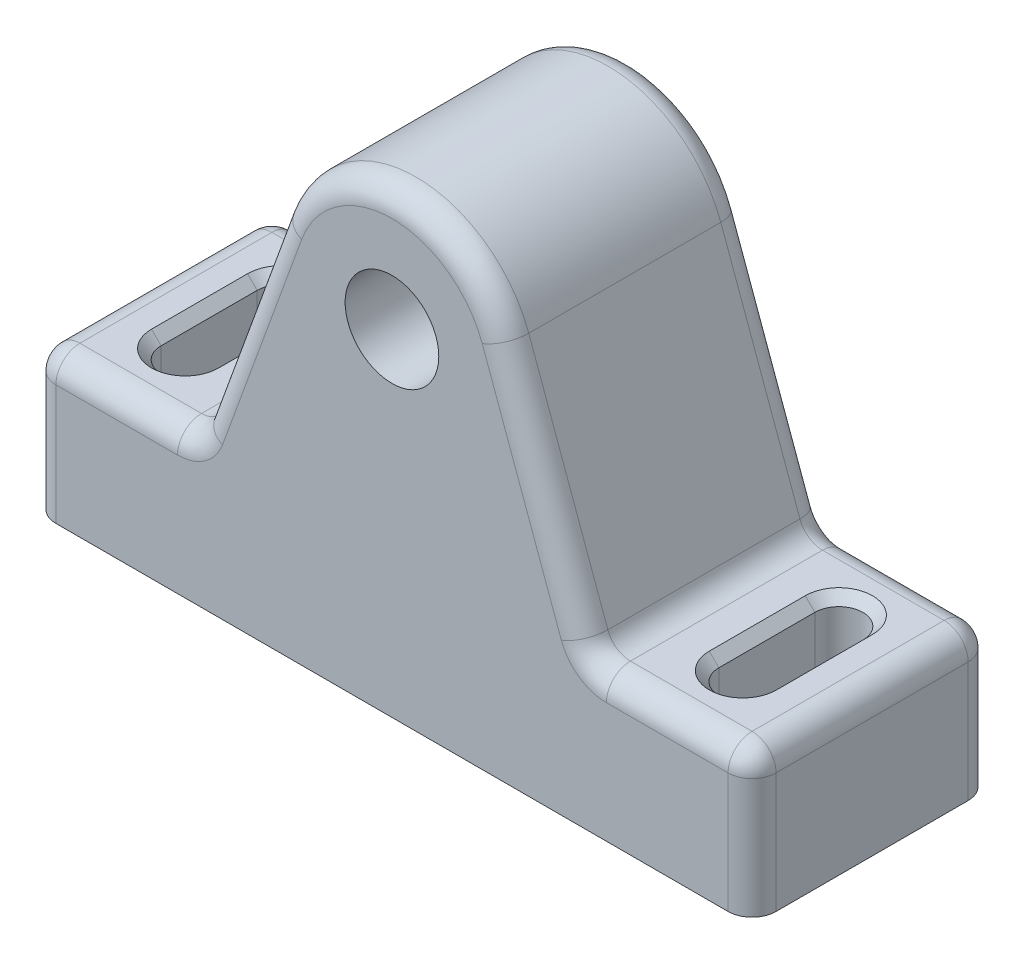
ISO-10303-21;
HEADER;
FILE_DESCRIPTION(('STEP AP214'),'2;1');
FILE_NAME('part.step','',(''),(''),'','','');
FILE_SCHEMA(('AUTOMOTIVE_DESIGN { 1 0 10303 214 1 1 1 1 }'));
ENDSEC;
DATA;
#1=APPLICATION_CONTEXT('core data for automotive mechanical design processes');
#2=APPLICATION_PROTOCOL_DEFINITION('international standard','automotive_design',2000,#1);
#3=PRODUCT_CONTEXT('',#1,'mechanical');
#4=PRODUCT('Part','Part','',(#3));
#5=PRODUCT_RELATED_PRODUCT_CATEGORY('part','',(#4));
#6=PRODUCT_DEFINITION_FORMATION('','',#4);
#7=PRODUCT_DEFINITION_CONTEXT('part definition',#1,'design');
#8=PRODUCT_DEFINITION('design','',#6,#7);
#9=PRODUCT_DEFINITION_SHAPE('','',#8);
#10=(LENGTH_UNIT() NAMED_UNIT(*) SI_UNIT(.MILLI.,.METRE.));
#11=(NAMED_UNIT(*) PLANE_ANGLE_UNIT() SI_UNIT($,.RADIAN.));
#12=(NAMED_UNIT(*) SI_UNIT($,.STERADIAN.) SOLID_ANGLE_UNIT());
#13=UNCERTAINTY_MEASURE_WITH_UNIT(LENGTH_MEASURE(1.E-05),#10,'distance_accuracy_value','');
#14=(GEOMETRIC_REPRESENTATION_CONTEXT(3) GLOBAL_UNCERTAINTY_ASSIGNED_CONTEXT((#13)) GLOBAL_UNIT_ASSIGNED_CONTEXT((#10,
#11,#12)) REPRESENTATION_CONTEXT('',''));
#15=CARTESIAN_POINT('',(0.,0.,0.));
#16=DIRECTION('',(0.,0.,1.));
#17=DIRECTION('',(1.,0.,0.));
#18=AXIS2_PLACEMENT_3D('',#15,#16,#17);
#19=CARTESIAN_POINT('',(0.,70.,25.));
#20=DIRECTION('',(0.,0.,-1.));
#21=DIRECTION('',(-1.,0.,0.));
#22=AXIS2_PLACEMENT_3D('',#19,#20,#21);
#23=PLANE('',#22);
#24=DIRECTION('',(1.,0.,0.));
#25=VECTOR('',#24,1.);
#26=CARTESIAN_POINT('',(75.,0.,25.));
#27=LINE('',#26,#25);
#28=CARTESIAN_POINT('',(-70.,0.,25.));
#29=VERTEX_POINT('',#28);
#30=CARTESIAN_POINT('',(70.,0.,25.));
#31=VERTEX_POINT('',#30);
#32=EDGE_CURVE('E332',#29,#31,#27,.T.);
#33=ORIENTED_EDGE('',*,*,#32,.T.);
#34=DIRECTION('',(0.,1.,0.));
#35=VECTOR('',#34,1.);
#36=CARTESIAN_POINT('',(70.,70.,25.));
#37=LINE('',#36,#35);
#38=CARTESIAN_POINT('',(70.,25.,25.));
#39=VERTEX_POINT('',#38);
#40=EDGE_CURVE('E368',#31,#39,#37,.T.);
#41=ORIENTED_EDGE('',*,*,#40,.T.);
#42=DIRECTION('',(-1.,0.,0.));
#43=VECTOR('',#42,1.);
#44=CARTESIAN_POINT('',(0.,25.,25.));
#45=LINE('',#44,#43);
#46=CARTESIAN_POINT('',(44.6642913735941,25.,25.));
#47=VERTEX_POINT('',#46);
#48=EDGE_CURVE('E365',#39,#47,#45,.T.);
#49=ORIENTED_EDGE('',*,*,#48,.T.);
#50=CARTESIAN_POINT('',(44.6642913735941,35.,25.));
#51=DIRECTION('',(0.,0.,-1.));
#52=DIRECTION('',(-1.,0.,0.));
#53=AXIS2_PLACEMENT_3D('',#50,#51,#52);
#54=CIRCLE('',#53,10.);
#55=CARTESIAN_POINT('',(35.267365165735,31.5797985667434,25.));
#56=VERTEX_POINT('',#55);
#57=EDGE_CURVE('E362',#56,#47,#54,.F.);
#58=ORIENTED_EDGE('',*,*,#57,.F.);
#59=DIRECTION('',(-0.342020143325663,0.939692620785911,0.));
#60=VECTOR('',#59,1.);
#61=CARTESIAN_POINT('',(18.7938524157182,76.8404028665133,25.));
#62=LINE('',#61,#60);
#63=CARTESIAN_POINT('',(18.7938524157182,76.8404028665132,25.));
#64=VERTEX_POINT('',#63);
#65=EDGE_CURVE('E360',#56,#64,#62,.T.);
#66=ORIENTED_EDGE('',*,*,#65,.T.);
#67=CARTESIAN_POINT('',(0.,70.,25.));
#68=DIRECTION('',(0.,0.,-1.));
#69=DIRECTION('',(-1.,0.,0.));
#70=AXIS2_PLACEMENT_3D('',#67,#68,#69);
#71=CIRCLE('',#70,20.);
#72=CARTESIAN_POINT('',(-18.7938524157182,76.8404028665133,25.));
#73=VERTEX_POINT('',#72);
#74=EDGE_CURVE('E358',#64,#73,#71,.F.);
#75=ORIENTED_EDGE('',*,*,#74,.T.);
#76=DIRECTION('',(-0.342020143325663,-0.939692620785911,0.));
#77=VECTOR('',#76,1.);
#78=CARTESIAN_POINT('',(-18.7938524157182,76.8404028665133,25.));
#79=LINE('',#78,#77);
#80=CARTESIAN_POINT('',(-35.267365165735,31.5797985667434,25.));
#81=VERTEX_POINT('',#80);
#82=EDGE_CURVE('E356',#73,#81,#79,.T.);
#83=ORIENTED_EDGE('',*,*,#82,.T.);
#84=CARTESIAN_POINT('',(-44.6642913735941,35.,25.));
#85=DIRECTION('',(0.,0.,-1.));
#86=DIRECTION('',(-1.,0.,0.));
#87=AXIS2_PLACEMENT_3D('',#84,#85,#86);
#88=CIRCLE('',#87,10.);
#89=CARTESIAN_POINT('',(-44.6642913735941,25.,25.));
#90=VERTEX_POINT('',#89);
#91=EDGE_CURVE('E353',#90,#81,#88,.F.);
#92=ORIENTED_EDGE('',*,*,#91,.F.);
#93=DIRECTION('',(-1.,0.,0.));
#94=VECTOR('',#93,1.);
#95=CARTESIAN_POINT('',(0.,25.,25.));
#96=LINE('',#95,#94);
#97=CARTESIAN_POINT('',(-70.,25.,25.));
#98=VERTEX_POINT('',#97);
#99=EDGE_CURVE('E351',#90,#98,#96,.T.);
#100=ORIENTED_EDGE('',*,*,#99,.T.);
#101=DIRECTION('',(0.,-1.,0.));
#102=VECTOR('',#101,1.);
#103=CARTESIAN_POINT('',(-70.,70.,25.));
#104=LINE('',#103,#102);
#105=EDGE_CURVE('E349',#98,#29,#104,.T.);
#106=ORIENTED_EDGE('',*,*,#105,.T.);
#107=EDGE_LOOP('',(#33,#41,#49,#58,#66,#75,#83,#92,#100,#106));
#108=FACE_BOUND('',#107,.T.);
#109=CARTESIAN_POINT('',(0.,70.,25.));
#110=DIRECTION('',(0.,0.,1.));
#111=DIRECTION('',(1.,0.,0.));
#112=AXIS2_PLACEMENT_3D('',#109,#110,#111);
#113=CIRCLE('',#112,9.75);
#114=CARTESIAN_POINT('',(9.75,70.,25.));
#115=VERTEX_POINT('',#114);
#116=EDGE_CURVE('E326',#115,#115,#113,.T.);
#117=ORIENTED_EDGE('',*,*,#116,.F.);
#118=EDGE_LOOP('',(#117));
#119=FACE_BOUND('',#118,.T.);
#120=ADVANCED_FACE('F44',(#108,#119),#23,.F.);
#121=CARTESIAN_POINT('',(0.,70.,-25.));
#122=DIRECTION('',(0.,0.,-1.));
#123=DIRECTION('',(-1.,0.,0.));
#124=AXIS2_PLACEMENT_3D('',#121,#122,#123);
#125=PLANE('',#124);
#126=DIRECTION('',(1.,0.,0.));
#127=VECTOR('',#126,1.);
#128=CARTESIAN_POINT('',(75.,0.,-25.));
#129=LINE('',#128,#127);
#130=CARTESIAN_POINT('',(-70.,0.,-25.));
#131=VERTEX_POINT('',#130);
#132=CARTESIAN_POINT('',(70.,0.,-25.));
#133=VERTEX_POINT('',#132);
#134=EDGE_CURVE('E329',#131,#133,#129,.T.);
#135=ORIENTED_EDGE('',*,*,#134,.F.);
#136=DIRECTION('',(0.,-1.,0.));
#137=VECTOR('',#136,1.);
#138=CARTESIAN_POINT('',(-70.,30.,-25.));
#139=LINE('',#138,#137);
#140=CARTESIAN_POINT('',(-70.,25.,-25.));
#141=VERTEX_POINT('',#140);
#142=EDGE_CURVE('E408',#131,#141,#139,.F.);
#143=ORIENTED_EDGE('',*,*,#142,.T.);
#144=DIRECTION('',(-1.,0.,0.));
#145=VECTOR('',#144,1.);
#146=CARTESIAN_POINT('',(-41.1632536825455,25.,-25.));
#147=LINE('',#146,#145);
#148=CARTESIAN_POINT('',(-44.6642913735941,25.,-25.));
#149=VERTEX_POINT('',#148);
#150=EDGE_CURVE('E406',#141,#149,#147,.F.);
#151=ORIENTED_EDGE('',*,*,#150,.T.);
#152=CARTESIAN_POINT('',(-44.6642913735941,35.,-25.));
#153=DIRECTION('',(0.,0.,-1.));
#154=DIRECTION('',(-1.,0.,0.));
#155=AXIS2_PLACEMENT_3D('',#152,#153,#154);
#156=CIRCLE('',#155,10.);
#157=CARTESIAN_POINT('',(-35.267365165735,31.5797985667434,-25.));
#158=VERTEX_POINT('',#157);
#159=EDGE_CURVE('E403',#158,#149,#156,.T.);
#160=ORIENTED_EDGE('',*,*,#159,.F.);
#161=DIRECTION('',(-0.342020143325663,-0.939692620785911,0.));
#162=VECTOR('',#161,1.);
#163=CARTESIAN_POINT('',(-18.7938524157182,76.8404028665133,-25.));
#164=LINE('',#163,#162);
#165=CARTESIAN_POINT('',(-18.7938524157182,76.8404028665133,-25.));
#166=VERTEX_POINT('',#165);
#167=EDGE_CURVE('E401',#158,#166,#164,.F.);
#168=ORIENTED_EDGE('',*,*,#167,.T.);
#169=CARTESIAN_POINT('',(0.,70.,-25.));
#170=DIRECTION('',(0.,0.,-1.));
#171=DIRECTION('',(-1.,0.,0.));
#172=AXIS2_PLACEMENT_3D('',#169,#170,#171);
#173=CIRCLE('',#172,20.);
#174=CARTESIAN_POINT('',(18.7938524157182,76.8404028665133,-25.));
#175=VERTEX_POINT('',#174);
#176=EDGE_CURVE('E399',#166,#175,#173,.T.);
#177=ORIENTED_EDGE('',*,*,#176,.T.);
#178=DIRECTION('',(-0.342020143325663,0.939692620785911,0.));
#179=VECTOR('',#178,1.);
#180=CARTESIAN_POINT('',(36.464790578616,28.2898992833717,-25.));
#181=LINE('',#180,#179);
#182=CARTESIAN_POINT('',(35.267365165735,31.5797985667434,-25.));
#183=VERTEX_POINT('',#182);
#184=EDGE_CURVE('E397',#175,#183,#181,.F.);
#185=ORIENTED_EDGE('',*,*,#184,.T.);
#186=CARTESIAN_POINT('',(44.6642913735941,35.,-25.));
#187=DIRECTION('',(0.,0.,-1.));
#188=DIRECTION('',(-1.,0.,0.));
#189=AXIS2_PLACEMENT_3D('',#186,#187,#188);
#190=CIRCLE('',#189,10.);
#191=CARTESIAN_POINT('',(44.6642913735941,25.,-25.));
#192=VERTEX_POINT('',#191);
#193=EDGE_CURVE('E394',#192,#183,#190,.T.);
#194=ORIENTED_EDGE('',*,*,#193,.F.);
#195=DIRECTION('',(-1.,0.,0.));
#196=VECTOR('',#195,1.);
#197=CARTESIAN_POINT('',(75.,25.,-25.));
#198=LINE('',#197,#196);
#199=CARTESIAN_POINT('',(70.,25.,-25.));
#200=VERTEX_POINT('',#199);
#201=EDGE_CURVE('E392',#192,#200,#198,.F.);
#202=ORIENTED_EDGE('',*,*,#201,.T.);
#203=DIRECTION('',(0.,1.,0.));
#204=VECTOR('',#203,1.);
#205=CARTESIAN_POINT('',(70.,0.,-25.));
#206=LINE('',#205,#204);
#207=EDGE_CURVE('E390',#200,#133,#206,.F.);
#208=ORIENTED_EDGE('',*,*,#207,.T.);
#209=EDGE_LOOP('',(#135,#143,#151,#160,#168,#177,#185,#194,#202,#208));
#210=FACE_BOUND('',#209,.T.);
#211=CARTESIAN_POINT('',(0.,70.,-25.));
#212=DIRECTION('',(0.,0.,1.));
#213=DIRECTION('',(1.,0.,0.));
#214=AXIS2_PLACEMENT_3D('',#211,#212,#213);
#215=CIRCLE('',#214,9.75);
#216=CARTESIAN_POINT('',(9.75,70.,-25.));
#217=VERTEX_POINT('',#216);
#218=EDGE_CURVE('E303',#217,#217,#215,.T.);
#219=ORIENTED_EDGE('',*,*,#218,.T.);
#220=EDGE_LOOP('',(#219));
#221=FACE_BOUND('',#220,.T.);
#222=ADVANCED_FACE('F612',(#210,#221),#125,.T.);
#223=CARTESIAN_POINT('',(-75.,0.,25.));
#224=DIRECTION('',(1.,0.,0.));
#225=DIRECTION('',(0.,1.,0.));
#226=AXIS2_PLACEMENT_3D('',#223,#224,#225);
#227=PLANE('',#226);
#228=DIRECTION('',(0.,0.,-1.));
#229=VECTOR('',#228,1.);
#230=CARTESIAN_POINT('',(-75.,0.,25.));
#231=LINE('',#230,#229);
#232=CARTESIAN_POINT('',(-75.,0.,20.));
#233=VERTEX_POINT('',#232);
#234=CARTESIAN_POINT('',(-75.,0.,-20.));
#235=VERTEX_POINT('',#234);
#236=EDGE_CURVE('E346',#233,#235,#231,.T.);
#237=ORIENTED_EDGE('',*,*,#236,.F.);
#238=DIRECTION('',(0.,-1.,0.));
#239=VECTOR('',#238,1.);
#240=CARTESIAN_POINT('',(-75.,0.,20.));
#241=LINE('',#240,#239);
#242=CARTESIAN_POINT('',(-75.,25.,20.));
#243=VERTEX_POINT('',#242);
#244=EDGE_CURVE('E443',#233,#243,#241,.F.);
#245=ORIENTED_EDGE('',*,*,#244,.T.);
#246=DIRECTION('',(0.,0.,-1.));
#247=VECTOR('',#246,1.);
#248=CARTESIAN_POINT('',(-75.,25.,25.));
#249=LINE('',#248,#247);
#250=CARTESIAN_POINT('',(-75.,25.,-20.));
#251=VERTEX_POINT('',#250);
#252=EDGE_CURVE('E441',#243,#251,#249,.T.);
#253=ORIENTED_EDGE('',*,*,#252,.T.);
#254=DIRECTION('',(0.,-1.,0.));
#255=VECTOR('',#254,1.);
#256=CARTESIAN_POINT('',(-75.,0.,-20.));
#257=LINE('',#256,#255);
#258=EDGE_CURVE('E439',#251,#235,#257,.T.);
#259=ORIENTED_EDGE('',*,*,#258,.T.);
#260=EDGE_LOOP('',(#237,#245,#253,#259));
#261=FACE_BOUND('',#260,.T.);
#262=ADVANCED_FACE('F618',(#261),#227,.F.);
#263=CARTESIAN_POINT('',(75.,0.,25.));
#264=DIRECTION('',(0.,1.,0.));
#265=DIRECTION('',(0.,0.,1.));
#266=AXIS2_PLACEMENT_3D('',#263,#264,#265);
#267=PLANE('',#266);
#268=DIRECTION('',(0.,0.,1.));
#269=VECTOR('',#268,1.);
#270=CARTESIAN_POINT('',(-63.0816268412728,0.,10.));
#271=LINE('',#270,#269);
#272=CARTESIAN_POINT('',(-63.0816268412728,0.,-10.));
#273=VERTEX_POINT('',#272);
#274=CARTESIAN_POINT('',(-63.0816268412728,0.,10.));
#275=VERTEX_POINT('',#274);
#276=EDGE_CURVE('E279',#273,#275,#271,.T.);
#277=ORIENTED_EDGE('',*,*,#276,.T.);
#278=CARTESIAN_POINT('',(-58.0816268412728,0.,10.));
#279=DIRECTION('',(0.,1.,0.));
#280=DIRECTION('',(-1.,0.,0.));
#281=AXIS2_PLACEMENT_3D('',#278,#279,#280);
#282=CIRCLE('',#281,5.);
#283=CARTESIAN_POINT('',(-53.0816268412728,0.,10.));
#284=VERTEX_POINT('',#283);
#285=EDGE_CURVE('E272',#275,#284,#282,.T.);
#286=ORIENTED_EDGE('',*,*,#285,.T.);
#287=DIRECTION('',(0.,0.,-1.));
#288=VECTOR('',#287,1.);
#289=CARTESIAN_POINT('',(-53.0816268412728,0.,10.));
#290=LINE('',#289,#288);
#291=CARTESIAN_POINT('',(-53.0816268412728,0.,-10.));
#292=VERTEX_POINT('',#291);
#293=EDGE_CURVE('E283',#284,#292,#290,.T.);
#294=ORIENTED_EDGE('',*,*,#293,.T.);
#295=CARTESIAN_POINT('',(-58.0816268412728,0.,-10.));
#296=DIRECTION('',(0.,1.,0.));
#297=DIRECTION('',(-1.,0.,0.));
#298=AXIS2_PLACEMENT_3D('',#295,#296,#297);
#299=CIRCLE('',#298,5.);
#300=EDGE_CURVE('E288',#292,#273,#299,.T.);
#301=ORIENTED_EDGE('',*,*,#300,.T.);
#302=EDGE_LOOP('',(#277,#286,#294,#301));
#303=FACE_BOUND('',#302,.T.);
#304=DIRECTION('',(0.,0.,1.));
#305=VECTOR('',#304,1.);
#306=CARTESIAN_POINT('',(53.0816268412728,0.,10.));
#307=LINE('',#306,#305);
#308=CARTESIAN_POINT('',(53.0816268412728,0.,-9.99999999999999));
#309=VERTEX_POINT('',#308);
#310=CARTESIAN_POINT('',(53.0816268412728,0.,10.));
#311=VERTEX_POINT('',#310);
#312=EDGE_CURVE('E311',#309,#311,#307,.T.);
#313=ORIENTED_EDGE('',*,*,#312,.T.);
#314=CARTESIAN_POINT('',(58.0816268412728,0.,10.));
#315=DIRECTION('',(0.,1.,0.));
#316=DIRECTION('',(1.,0.,0.));
#317=AXIS2_PLACEMENT_3D('',#314,#315,#316);
#318=CIRCLE('',#317,5.);
#319=CARTESIAN_POINT('',(63.0816268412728,0.,10.));
#320=VERTEX_POINT('',#319);
#321=EDGE_CURVE('E293',#311,#320,#318,.T.);
#322=ORIENTED_EDGE('',*,*,#321,.T.);
#323=DIRECTION('',(0.,0.,-1.));
#324=VECTOR('',#323,1.);
#325=CARTESIAN_POINT('',(63.0816268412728,0.,10.));
#326=LINE('',#325,#324);
#327=CARTESIAN_POINT('',(63.0816268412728,0.,-9.99999999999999));
#328=VERTEX_POINT('',#327);
#329=EDGE_CURVE('E296',#320,#328,#326,.T.);
#330=ORIENTED_EDGE('',*,*,#329,.T.);
#331=CARTESIAN_POINT('',(58.0816268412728,0.,-9.99999999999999));
#332=DIRECTION('',(0.,1.,0.));
#333=DIRECTION('',(1.,0.,0.));
#334=AXIS2_PLACEMENT_3D('',#331,#332,#333);
#335=CIRCLE('',#334,5.);
#336=EDGE_CURVE('E321',#328,#309,#335,.T.);
#337=ORIENTED_EDGE('',*,*,#336,.T.);
#338=EDGE_LOOP('',(#313,#322,#330,#337));
#339=FACE_BOUND('',#338,.T.);
#340=DIRECTION('',(0.,0.,-1.));
#341=VECTOR('',#340,1.);
#342=CARTESIAN_POINT('',(75.,0.,25.));
#343=LINE('',#342,#341);
#344=CARTESIAN_POINT('',(75.,0.,20.));
#345=VERTEX_POINT('',#344);
#346=CARTESIAN_POINT('',(75.,0.,-20.));
#347=VERTEX_POINT('',#346);
#348=EDGE_CURVE('E343',#345,#347,#343,.T.);
#349=ORIENTED_EDGE('',*,*,#348,.F.);
#350=CARTESIAN_POINT('',(70.,0.,20.));
#351=DIRECTION('',(0.,1.,0.));
#352=DIRECTION('',(0.,0.,1.));
#353=AXIS2_PLACEMENT_3D('',#350,#351,#352);
#354=CIRCLE('',#353,5.);
#355=EDGE_CURVE('E428',#345,#31,#354,.F.);
#356=ORIENTED_EDGE('',*,*,#355,.T.);
#357=ORIENTED_EDGE('',*,*,#32,.F.);
#358=CARTESIAN_POINT('',(-70.,0.,20.));
#359=DIRECTION('',(0.,1.,0.));
#360=DIRECTION('',(0.,0.,1.));
#361=AXIS2_PLACEMENT_3D('',#358,#359,#360);
#362=CIRCLE('',#361,5.);
#363=EDGE_CURVE('E426',#29,#233,#362,.F.);
#364=ORIENTED_EDGE('',*,*,#363,.T.);
#365=ORIENTED_EDGE('',*,*,#236,.T.);
#366=CARTESIAN_POINT('',(-70.,0.,-20.));
#367=DIRECTION('',(0.,1.,0.));
#368=DIRECTION('',(0.,0.,1.));
#369=AXIS2_PLACEMENT_3D('',#366,#367,#368);
#370=CIRCLE('',#369,5.);
#371=EDGE_CURVE('E424',#235,#131,#370,.F.);
#372=ORIENTED_EDGE('',*,*,#371,.T.);
#373=ORIENTED_EDGE('',*,*,#134,.T.);
#374=CARTESIAN_POINT('',(70.,0.,-20.));
#375=DIRECTION('',(0.,1.,0.));
#376=DIRECTION('',(0.,0.,1.));
#377=AXIS2_PLACEMENT_3D('',#374,#375,#376);
#378=CIRCLE('',#377,5.);
#379=EDGE_CURVE('E422',#133,#347,#378,.F.);
#380=ORIENTED_EDGE('',*,*,#379,.T.);
#381=EDGE_LOOP('',(#349,#356,#357,#364,#365,#372,#373,#380));
#382=FACE_BOUND('',#381,.T.);
#383=ADVANCED_FACE('F290',(#303,#339,#382),#267,.F.);
#384=CARTESIAN_POINT('',(75.,0.,25.));
#385=DIRECTION('',(-1.,0.,0.));
#386=DIRECTION('',(0.,-1.,0.));
#387=AXIS2_PLACEMENT_3D('',#384,#385,#386);
#388=PLANE('',#387);
#389=DIRECTION('',(0.,0.,-1.));
#390=VECTOR('',#389,1.);
#391=CARTESIAN_POINT('',(75.,25.,25.));
#392=LINE('',#391,#390);
#393=CARTESIAN_POINT('',(75.,25.,-20.));
#394=VERTEX_POINT('',#393);
#395=CARTESIAN_POINT('',(75.,25.,20.));
#396=VERTEX_POINT('',#395);
#397=EDGE_CURVE('E418',#394,#396,#392,.F.);
#398=ORIENTED_EDGE('',*,*,#397,.T.);
#399=DIRECTION('',(0.,1.,0.));
#400=VECTOR('',#399,1.);
#401=CARTESIAN_POINT('',(75.,0.,20.));
#402=LINE('',#401,#400);
#403=EDGE_CURVE('E420',#396,#345,#402,.F.);
#404=ORIENTED_EDGE('',*,*,#403,.T.);
#405=ORIENTED_EDGE('',*,*,#348,.T.);
#406=DIRECTION('',(0.,1.,0.));
#407=VECTOR('',#406,1.);
#408=CARTESIAN_POINT('',(75.,30.,-20.));
#409=LINE('',#408,#407);
#410=EDGE_CURVE('E416',#347,#394,#409,.T.);
#411=ORIENTED_EDGE('',*,*,#410,.T.);
#412=EDGE_LOOP('',(#398,#404,#405,#411));
#413=FACE_BOUND('',#412,.T.);
#414=ADVANCED_FACE('F642',(#413),#388,.F.);
#415=CARTESIAN_POINT('',(75.,30.,25.));
#416=DIRECTION('',(0.,-1.,0.));
#417=DIRECTION('',(1.,0.,0.));
#418=AXIS2_PLACEMENT_3D('',#415,#416,#417);
#419=PLANE('',#418);
#420=CARTESIAN_POINT('',(58.0816268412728,30.,-9.99999999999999));
#421=DIRECTION('',(0.,-1.,0.));
#422=DIRECTION('',(1.,0.,0.));
#423=AXIS2_PLACEMENT_3D('',#420,#421,#422);
#424=CIRCLE('',#423,7.00000000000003);
#425=CARTESIAN_POINT('',(51.0816268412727,30.,-9.99999999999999));
#426=VERTEX_POINT('',#425);
#427=CARTESIAN_POINT('',(65.0816268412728,30.,-9.99999999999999));
#428=VERTEX_POINT('',#427);
#429=EDGE_CURVE('E549',#426,#428,#424,.T.);
#430=ORIENTED_EDGE('',*,*,#429,.T.);
#431=DIRECTION('',(0.,0.,1.));
#432=VECTOR('',#431,1.);
#433=CARTESIAN_POINT('',(65.0816268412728,30.,25.));
#434=LINE('',#433,#432);
#435=CARTESIAN_POINT('',(65.0816268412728,30.,10.));
#436=VERTEX_POINT('',#435);
#437=EDGE_CURVE('E551',#428,#436,#434,.T.);
#438=ORIENTED_EDGE('',*,*,#437,.T.);
#439=CARTESIAN_POINT('',(58.0816268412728,30.,10.));
#440=DIRECTION('',(0.,-1.,0.));
#441=DIRECTION('',(1.,0.,0.));
#442=AXIS2_PLACEMENT_3D('',#439,#440,#441);
#443=CIRCLE('',#442,7.00000000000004);
#444=CARTESIAN_POINT('',(51.0816268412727,30.,10.));
#445=VERTEX_POINT('',#444);
#446=EDGE_CURVE('E547',#436,#445,#443,.T.);
#447=ORIENTED_EDGE('',*,*,#446,.T.);
#448=DIRECTION('',(0.,0.,-1.));
#449=VECTOR('',#448,1.);
#450=CARTESIAN_POINT('',(51.0816268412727,30.,25.));
#451=LINE('',#450,#449);
#452=EDGE_CURVE('E545',#445,#426,#451,.T.);
#453=ORIENTED_EDGE('',*,*,#452,.T.);
#454=EDGE_LOOP('',(#430,#438,#447,#453));
#455=FACE_BOUND('',#454,.T.);
#456=DIRECTION('',(0.,0.,-1.));
#457=VECTOR('',#456,1.);
#458=CARTESIAN_POINT('',(44.6642913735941,30.,25.));
#459=LINE('',#458,#457);
#460=CARTESIAN_POINT('',(44.6642913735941,30.,-20.));
#461=VERTEX_POINT('',#460);
#462=CARTESIAN_POINT('',(44.6642913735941,30.,20.));
#463=VERTEX_POINT('',#462);
#464=EDGE_CURVE('E370',#461,#463,#459,.F.);
#465=ORIENTED_EDGE('',*,*,#464,.T.);
#466=DIRECTION('',(-1.,0.,0.));
#467=VECTOR('',#466,1.);
#468=CARTESIAN_POINT('',(75.,30.,20.));
#469=LINE('',#468,#467);
#470=CARTESIAN_POINT('',(70.,30.,20.));
#471=VERTEX_POINT('',#470);
#472=EDGE_CURVE('E376',#463,#471,#469,.F.);
#473=ORIENTED_EDGE('',*,*,#472,.T.);
#474=DIRECTION('',(0.,0.,-1.));
#475=VECTOR('',#474,1.);
#476=CARTESIAN_POINT('',(70.,30.,25.));
#477=LINE('',#476,#475);
#478=CARTESIAN_POINT('',(70.,30.,-20.));
#479=VERTEX_POINT('',#478);
#480=EDGE_CURVE('E374',#471,#479,#477,.T.);
#481=ORIENTED_EDGE('',*,*,#480,.T.);
#482=DIRECTION('',(-1.,0.,0.));
#483=VECTOR('',#482,1.);
#484=CARTESIAN_POINT('',(41.1632536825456,30.,-20.));
#485=LINE('',#484,#483);
#486=EDGE_CURVE('E372',#479,#461,#485,.T.);
#487=ORIENTED_EDGE('',*,*,#486,.T.);
#488=EDGE_LOOP('',(#465,#473,#481,#487));
#489=FACE_BOUND('',#488,.T.);
#490=ADVANCED_FACE('F583',(#455,#489),#419,.F.);
#491=CARTESIAN_POINT('',(41.1632536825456,30.,25.));
#492=DIRECTION('',(-0.939692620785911,-0.342020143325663,0.));
#493=DIRECTION('',(0.342020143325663,-0.939692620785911,0.));
#494=AXIS2_PLACEMENT_3D('',#491,#492,#493);
#495=PLANE('',#494);
#496=DIRECTION('',(0.,0.,-1.));
#497=VECTOR('',#496,1.);
#498=CARTESIAN_POINT('',(23.4923155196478,78.5505035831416,25.));
#499=LINE('',#498,#497);
#500=CARTESIAN_POINT('',(23.4923155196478,78.5505035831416,20.));
#501=VERTEX_POINT('',#500);
#502=CARTESIAN_POINT('',(23.4923155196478,78.5505035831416,-20.));
#503=VERTEX_POINT('',#502);
#504=EDGE_CURVE('E340',#501,#503,#499,.T.);
#505=ORIENTED_EDGE('',*,*,#504,.F.);
#506=DIRECTION('',(-0.342020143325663,0.939692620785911,0.));
#507=VECTOR('',#506,1.);
#508=CARTESIAN_POINT('',(41.1632536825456,30.,20.));
#509=LINE('',#508,#507);
#510=CARTESIAN_POINT('',(39.9658282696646,33.2898992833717,20.));
#511=VERTEX_POINT('',#510);
#512=EDGE_CURVE('E383',#501,#511,#509,.F.);
#513=ORIENTED_EDGE('',*,*,#512,.T.);
#514=DIRECTION('',(0.,0.,-1.));
#515=VECTOR('',#514,1.);
#516=CARTESIAN_POINT('',(39.9658282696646,33.2898992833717,-25.));
#517=LINE('',#516,#515);
#518=CARTESIAN_POINT('',(39.9658282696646,33.2898992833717,-20.));
#519=VERTEX_POINT('',#518);
#520=EDGE_CURVE('E379',#511,#519,#517,.T.);
#521=ORIENTED_EDGE('',*,*,#520,.T.);
#522=DIRECTION('',(-0.342020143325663,0.939692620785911,0.));
#523=VECTOR('',#522,1.);
#524=CARTESIAN_POINT('',(23.4923155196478,78.5505035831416,-20.));
#525=LINE('',#524,#523);
#526=EDGE_CURVE('E381',#519,#503,#525,.T.);
#527=ORIENTED_EDGE('',*,*,#526,.T.);
#528=EDGE_LOOP('',(#505,#513,#521,#527));
#529=FACE_BOUND('',#528,.T.);
#530=ADVANCED_FACE('F635',(#529),#495,.F.);
#531=CARTESIAN_POINT('',(0.,70.,25.));
#532=DIRECTION('',(0.,0.,-1.));
#533=DIRECTION('',(-1.,0.,0.));
#534=AXIS2_PLACEMENT_3D('',#531,#532,#533);
#535=CYLINDRICAL_SURFACE('',#534,25.);
#536=DIRECTION('',(0.,0.,-1.));
#537=VECTOR('',#536,1.);
#538=CARTESIAN_POINT('',(-23.4923155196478,78.5505035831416,25.));
#539=LINE('',#538,#537);
#540=CARTESIAN_POINT('',(-23.4923155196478,78.5505035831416,20.));
#541=VERTEX_POINT('',#540);
#542=CARTESIAN_POINT('',(-23.4923155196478,78.5505035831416,-20.));
#543=VERTEX_POINT('',#542);
#544=EDGE_CURVE('E335',#541,#543,#539,.T.);
#545=ORIENTED_EDGE('',*,*,#544,.F.);
#546=CARTESIAN_POINT('',(0.,70.,20.));
#547=DIRECTION('',(0.,0.,-1.));
#548=DIRECTION('',(-1.,0.,0.));
#549=AXIS2_PLACEMENT_3D('',#546,#547,#548);
#550=CIRCLE('',#549,25.);
#551=EDGE_CURVE('E388',#541,#501,#550,.T.);
#552=ORIENTED_EDGE('',*,*,#551,.T.);
#553=ORIENTED_EDGE('',*,*,#504,.T.);
#554=CARTESIAN_POINT('',(0.,70.,-20.));
#555=DIRECTION('',(0.,0.,-1.));
#556=DIRECTION('',(-1.,0.,0.));
#557=AXIS2_PLACEMENT_3D('',#554,#555,#556);
#558=CIRCLE('',#557,25.);
#559=EDGE_CURVE('E386',#503,#543,#558,.F.);
#560=ORIENTED_EDGE('',*,*,#559,.T.);
#561=EDGE_LOOP('',(#545,#552,#553,#560));
#562=FACE_BOUND('',#561,.T.);
#563=ADVANCED_FACE('F631',(#562),#535,.T.);
#564=CARTESIAN_POINT('',(-41.1632536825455,30.,25.));
#565=DIRECTION('',(0.939692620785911,-0.342020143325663,0.));
#566=DIRECTION('',(0.342020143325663,0.939692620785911,0.));
#567=AXIS2_PLACEMENT_3D('',#564,#565,#566);
#568=PLANE('',#567);
#569=DIRECTION('',(0.,0.,-1.));
#570=VECTOR('',#569,1.);
#571=CARTESIAN_POINT('',(-39.9658282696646,33.2898992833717,25.));
#572=LINE('',#571,#570);
#573=CARTESIAN_POINT('',(-39.9658282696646,33.2898992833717,-20.));
#574=VERTEX_POINT('',#573);
#575=CARTESIAN_POINT('',(-39.9658282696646,33.2898992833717,20.));
#576=VERTEX_POINT('',#575);
#577=EDGE_CURVE('E410',#574,#576,#572,.F.);
#578=ORIENTED_EDGE('',*,*,#577,.T.);
#579=DIRECTION('',(-0.342020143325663,-0.939692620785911,0.));
#580=VECTOR('',#579,1.);
#581=CARTESIAN_POINT('',(-41.1632536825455,30.,20.));
#582=LINE('',#581,#580);
#583=EDGE_CURVE('E414',#576,#541,#582,.F.);
#584=ORIENTED_EDGE('',*,*,#583,.T.);
#585=ORIENTED_EDGE('',*,*,#544,.T.);
#586=DIRECTION('',(-0.342020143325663,-0.939692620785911,0.));
#587=VECTOR('',#586,1.);
#588=CARTESIAN_POINT('',(-41.1632536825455,30.,-20.));
#589=LINE('',#588,#587);
#590=EDGE_CURVE('E412',#543,#574,#589,.T.);
#591=ORIENTED_EDGE('',*,*,#590,.T.);
#592=EDGE_LOOP('',(#578,#584,#585,#591));
#593=FACE_BOUND('',#592,.T.);
#594=ADVANCED_FACE('F627',(#593),#568,.F.);
#595=CARTESIAN_POINT('',(-75.,30.,25.));
#596=DIRECTION('',(0.,-1.,0.));
#597=DIRECTION('',(1.,0.,0.));
#598=AXIS2_PLACEMENT_3D('',#595,#596,#597);
#599=PLANE('',#598);
#600=CARTESIAN_POINT('',(-58.0816268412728,30.,10.));
#601=DIRECTION('',(0.,-1.,0.));
#602=DIRECTION('',(1.,0.,0.));
#603=AXIS2_PLACEMENT_3D('',#600,#601,#602);
#604=CIRCLE('',#603,7.00000000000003);
#605=CARTESIAN_POINT('',(-51.0816268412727,30.,10.));
#606=VERTEX_POINT('',#605);
#607=CARTESIAN_POINT('',(-65.0816268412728,30.,10.));
#608=VERTEX_POINT('',#607);
#609=EDGE_CURVE('E532',#606,#608,#604,.T.);
#610=ORIENTED_EDGE('',*,*,#609,.T.);
#611=DIRECTION('',(0.,0.,-1.));
#612=VECTOR('',#611,1.);
#613=CARTESIAN_POINT('',(-65.0816268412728,30.,25.));
#614=LINE('',#613,#612);
#615=CARTESIAN_POINT('',(-65.0816268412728,30.,-10.));
#616=VERTEX_POINT('',#615);
#617=EDGE_CURVE('E534',#608,#616,#614,.T.);
#618=ORIENTED_EDGE('',*,*,#617,.T.);
#619=CARTESIAN_POINT('',(-58.0816268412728,30.,-10.));
#620=DIRECTION('',(0.,-1.,0.));
#621=DIRECTION('',(1.,0.,0.));
#622=AXIS2_PLACEMENT_3D('',#619,#620,#621);
#623=CIRCLE('',#622,7.00000000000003);
#624=CARTESIAN_POINT('',(-51.0816268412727,30.,-10.));
#625=VERTEX_POINT('',#624);
#626=EDGE_CURVE('E530',#616,#625,#623,.T.);
#627=ORIENTED_EDGE('',*,*,#626,.T.);
#628=DIRECTION('',(0.,0.,1.));
#629=VECTOR('',#628,1.);
#630=CARTESIAN_POINT('',(-51.0816268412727,30.,25.));
#631=LINE('',#630,#629);
#632=EDGE_CURVE('E528',#625,#606,#631,.T.);
#633=ORIENTED_EDGE('',*,*,#632,.T.);
#634=EDGE_LOOP('',(#610,#618,#627,#633));
#635=FACE_BOUND('',#634,.T.);
#636=DIRECTION('',(0.,0.,-1.));
#637=VECTOR('',#636,1.);
#638=CARTESIAN_POINT('',(-70.,30.,25.));
#639=LINE('',#638,#637);
#640=CARTESIAN_POINT('',(-70.,30.,-20.));
#641=VERTEX_POINT('',#640);
#642=CARTESIAN_POINT('',(-70.,30.,20.));
#643=VERTEX_POINT('',#642);
#644=EDGE_CURVE('E432',#641,#643,#639,.F.);
#645=ORIENTED_EDGE('',*,*,#644,.T.);
#646=DIRECTION('',(-1.,0.,0.));
#647=VECTOR('',#646,1.);
#648=CARTESIAN_POINT('',(-75.,30.,20.));
#649=LINE('',#648,#647);
#650=CARTESIAN_POINT('',(-44.6642913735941,30.,20.));
#651=VERTEX_POINT('',#650);
#652=EDGE_CURVE('E436',#643,#651,#649,.F.);
#653=ORIENTED_EDGE('',*,*,#652,.T.);
#654=DIRECTION('',(0.,0.,-1.));
#655=VECTOR('',#654,1.);
#656=CARTESIAN_POINT('',(-44.6642913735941,30.,-25.));
#657=LINE('',#656,#655);
#658=CARTESIAN_POINT('',(-44.6642913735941,30.,-20.));
#659=VERTEX_POINT('',#658);
#660=EDGE_CURVE('E434',#651,#659,#657,.T.);
#661=ORIENTED_EDGE('',*,*,#660,.T.);
#662=DIRECTION('',(-1.,0.,0.));
#663=VECTOR('',#662,1.);
#664=CARTESIAN_POINT('',(-75.,30.,-20.));
#665=LINE('',#664,#663);
#666=EDGE_CURVE('E430',#659,#641,#665,.T.);
#667=ORIENTED_EDGE('',*,*,#666,.T.);
#668=EDGE_LOOP('',(#645,#653,#661,#667));
#669=FACE_BOUND('',#668,.T.);
#670=ADVANCED_FACE('F624',(#635,#669),#599,.F.);
#671=CARTESIAN_POINT('',(0.,70.,25.));
#672=DIRECTION('',(0.,0.,-1.));
#673=DIRECTION('',(-1.,0.,0.));
#674=AXIS2_PLACEMENT_3D('',#671,#672,#673);
#675=CYLINDRICAL_SURFACE('',#674,9.75);
#676=ORIENTED_EDGE('',*,*,#116,.T.);
#677=EDGE_LOOP('',(#676));
#678=FACE_BOUND('',#677,.T.);
#679=ORIENTED_EDGE('',*,*,#218,.F.);
#680=EDGE_LOOP('',(#679));
#681=FACE_BOUND('',#680,.T.);
#682=ADVANCED_FACE('F622',(#678,#681),#675,.F.);
#683=CARTESIAN_POINT('',(-58.0816268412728,0.,10.));
#684=DIRECTION('',(0.,1.,0.));
#685=DIRECTION('',(-1.,0.,0.));
#686=AXIS2_PLACEMENT_3D('',#683,#684,#685);
#687=CYLINDRICAL_SURFACE('',#686,5.);
#688=DIRECTION('',(0.,1.,0.));
#689=VECTOR('',#688,1.);
#690=CARTESIAN_POINT('',(-63.0816268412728,0.,10.));
#691=LINE('',#690,#689);
#692=CARTESIAN_POINT('',(-63.0816268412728,28.,10.));
#693=VERTEX_POINT('',#692);
#694=EDGE_CURVE('E301',#275,#693,#691,.T.);
#695=ORIENTED_EDGE('',*,*,#694,.T.);
#696=CARTESIAN_POINT('',(-58.0816268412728,28.,10.));
#697=DIRECTION('',(0.,-1.,0.));
#698=DIRECTION('',(0.,0.,-1.));
#699=AXIS2_PLACEMENT_3D('',#696,#697,#698);
#700=CIRCLE('',#699,5.);
#701=CARTESIAN_POINT('',(-53.0816268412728,28.,10.));
#702=VERTEX_POINT('',#701);
#703=EDGE_CURVE('E275',#693,#702,#700,.F.);
#704=ORIENTED_EDGE('',*,*,#703,.T.);
#705=DIRECTION('',(0.,1.,0.));
#706=VECTOR('',#705,1.);
#707=CARTESIAN_POINT('',(-53.0816268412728,0.,10.));
#708=LINE('',#707,#706);
#709=EDGE_CURVE('E267',#284,#702,#708,.T.);
#710=ORIENTED_EDGE('',*,*,#709,.F.);
#711=ORIENTED_EDGE('',*,*,#285,.F.);
#712=EDGE_LOOP('',(#695,#704,#710,#711));
#713=FACE_BOUND('',#712,.T.);
#714=ADVANCED_FACE('F270',(#713),#687,.F.);
#715=CARTESIAN_POINT('',(-63.0816268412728,0.,10.));
#716=DIRECTION('',(-1.,0.,0.));
#717=DIRECTION('',(0.,-1.,0.));
#718=AXIS2_PLACEMENT_3D('',#715,#716,#717);
#719=PLANE('',#718);
#720=DIRECTION('',(0.,1.,0.));
#721=VECTOR('',#720,1.);
#722=CARTESIAN_POINT('',(-63.0816268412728,0.,-10.));
#723=LINE('',#722,#721);
#724=CARTESIAN_POINT('',(-63.0816268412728,28.,-10.));
#725=VERTEX_POINT('',#724);
#726=EDGE_CURVE('E304',#273,#725,#723,.T.);
#727=ORIENTED_EDGE('',*,*,#726,.T.);
#728=DIRECTION('',(0.,0.,1.));
#729=VECTOR('',#728,1.);
#730=CARTESIAN_POINT('',(-63.0816268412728,28.,10.));
#731=LINE('',#730,#729);
#732=EDGE_CURVE('E445',#725,#693,#731,.T.);
#733=ORIENTED_EDGE('',*,*,#732,.T.);
#734=ORIENTED_EDGE('',*,*,#694,.F.);
#735=ORIENTED_EDGE('',*,*,#276,.F.);
#736=EDGE_LOOP('',(#727,#733,#734,#735));
#737=FACE_BOUND('',#736,.T.);
#738=ADVANCED_FACE('F965',(#737),#719,.F.);
#739=CARTESIAN_POINT('',(-58.0816268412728,0.,-10.));
#740=DIRECTION('',(0.,1.,0.));
#741=DIRECTION('',(-1.,0.,0.));
#742=AXIS2_PLACEMENT_3D('',#739,#740,#741);
#743=CYLINDRICAL_SURFACE('',#742,5.);
#744=DIRECTION('',(0.,1.,0.));
#745=VECTOR('',#744,1.);
#746=CARTESIAN_POINT('',(-53.0816268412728,0.,-10.));
#747=LINE('',#746,#745);
#748=CARTESIAN_POINT('',(-53.0816268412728,28.,-10.));
#749=VERTEX_POINT('',#748);
#750=EDGE_CURVE('E278',#292,#749,#747,.T.);
#751=ORIENTED_EDGE('',*,*,#750,.T.);
#752=CARTESIAN_POINT('',(-58.0816268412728,28.,-10.));
#753=DIRECTION('',(0.,-1.,0.));
#754=DIRECTION('',(0.,0.,-1.));
#755=AXIS2_PLACEMENT_3D('',#752,#753,#754);
#756=CIRCLE('',#755,5.);
#757=EDGE_CURVE('E538',#749,#725,#756,.F.);
#758=ORIENTED_EDGE('',*,*,#757,.T.);
#759=ORIENTED_EDGE('',*,*,#726,.F.);
#760=ORIENTED_EDGE('',*,*,#300,.F.);
#761=EDGE_LOOP('',(#751,#758,#759,#760));
#762=FACE_BOUND('',#761,.T.);
#763=ADVANCED_FACE('F955',(#762),#743,.F.);
#764=CARTESIAN_POINT('',(-53.0816268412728,0.,10.));
#765=DIRECTION('',(1.,0.,0.));
#766=DIRECTION('',(0.,1.,0.));
#767=AXIS2_PLACEMENT_3D('',#764,#765,#766);
#768=PLANE('',#767);
#769=ORIENTED_EDGE('',*,*,#709,.T.);
#770=DIRECTION('',(0.,0.,-1.));
#771=VECTOR('',#770,1.);
#772=CARTESIAN_POINT('',(-53.0816268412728,28.,10.));
#773=LINE('',#772,#771);
#774=EDGE_CURVE('E540',#702,#749,#773,.T.);
#775=ORIENTED_EDGE('',*,*,#774,.T.);
#776=ORIENTED_EDGE('',*,*,#750,.F.);
#777=ORIENTED_EDGE('',*,*,#293,.F.);
#778=EDGE_LOOP('',(#769,#775,#776,#777));
#779=FACE_BOUND('',#778,.T.);
#780=ADVANCED_FACE('F284',(#779),#768,.F.);
#781=CARTESIAN_POINT('',(58.0816268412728,0.,10.));
#782=DIRECTION('',(0.,1.,0.));
#783=DIRECTION('',(-1.,0.,0.));
#784=AXIS2_PLACEMENT_3D('',#781,#782,#783);
#785=CYLINDRICAL_SURFACE('',#784,5.);
#786=DIRECTION('',(0.,1.,0.));
#787=VECTOR('',#786,1.);
#788=CARTESIAN_POINT('',(53.0816268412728,0.,10.));
#789=LINE('',#788,#787);
#790=CARTESIAN_POINT('',(53.0816268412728,28.,10.));
#791=VERTEX_POINT('',#790);
#792=EDGE_CURVE('E316',#311,#791,#789,.T.);
#793=ORIENTED_EDGE('',*,*,#792,.T.);
#794=CARTESIAN_POINT('',(58.0816268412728,28.,10.));
#795=DIRECTION('',(0.,-1.,0.));
#796=DIRECTION('',(0.,0.,-1.));
#797=AXIS2_PLACEMENT_3D('',#794,#795,#796);
#798=CIRCLE('',#797,5.);
#799=CARTESIAN_POINT('',(63.0816268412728,28.,10.));
#800=VERTEX_POINT('',#799);
#801=EDGE_CURVE('E54',#791,#800,#798,.F.);
#802=ORIENTED_EDGE('',*,*,#801,.T.);
#803=DIRECTION('',(0.,1.,0.));
#804=VECTOR('',#803,1.);
#805=CARTESIAN_POINT('',(63.0816268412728,0.,10.));
#806=LINE('',#805,#804);
#807=EDGE_CURVE('E308',#320,#800,#806,.T.);
#808=ORIENTED_EDGE('',*,*,#807,.F.);
#809=ORIENTED_EDGE('',*,*,#321,.F.);
#810=EDGE_LOOP('',(#793,#802,#808,#809));
#811=FACE_BOUND('',#810,.T.);
#812=ADVANCED_FACE('F600',(#811),#785,.F.);
#813=CARTESIAN_POINT('',(53.0816268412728,0.,10.));
#814=DIRECTION('',(-1.,0.,0.));
#815=DIRECTION('',(0.,-1.,0.));
#816=AXIS2_PLACEMENT_3D('',#813,#814,#815);
#817=PLANE('',#816);
#818=DIRECTION('',(0.,1.,0.));
#819=VECTOR('',#818,1.);
#820=CARTESIAN_POINT('',(53.0816268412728,0.,-9.99999999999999));
#821=LINE('',#820,#819);
#822=CARTESIAN_POINT('',(53.0816268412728,28.,-9.99999999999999));
#823=VERTEX_POINT('',#822);
#824=EDGE_CURVE('E314',#309,#823,#821,.T.);
#825=ORIENTED_EDGE('',*,*,#824,.T.);
#826=DIRECTION('',(0.,0.,1.));
#827=VECTOR('',#826,1.);
#828=CARTESIAN_POINT('',(53.0816268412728,28.,10.));
#829=LINE('',#828,#827);
#830=EDGE_CURVE('E11',#823,#791,#829,.T.);
#831=ORIENTED_EDGE('',*,*,#830,.T.);
#832=ORIENTED_EDGE('',*,*,#792,.F.);
#833=ORIENTED_EDGE('',*,*,#312,.F.);
#834=EDGE_LOOP('',(#825,#831,#832,#833));
#835=FACE_BOUND('',#834,.T.);
#836=ADVANCED_FACE('F601',(#835),#817,.F.);
#837=CARTESIAN_POINT('',(58.0816268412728,0.,-9.99999999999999));
#838=DIRECTION('',(0.,1.,0.));
#839=DIRECTION('',(-1.,0.,0.));
#840=AXIS2_PLACEMENT_3D('',#837,#838,#839);
#841=CYLINDRICAL_SURFACE('',#840,5.);
#842=DIRECTION('',(0.,1.,0.));
#843=VECTOR('',#842,1.);
#844=CARTESIAN_POINT('',(63.0816268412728,0.,-9.99999999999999));
#845=LINE('',#844,#843);
#846=CARTESIAN_POINT('',(63.0816268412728,28.,-9.99999999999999));
#847=VERTEX_POINT('',#846);
#848=EDGE_CURVE('E312',#328,#847,#845,.T.);
#849=ORIENTED_EDGE('',*,*,#848,.T.);
#850=CARTESIAN_POINT('',(58.0816268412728,28.,-9.99999999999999));
#851=DIRECTION('',(0.,-1.,0.));
#852=DIRECTION('',(0.,0.,-1.));
#853=AXIS2_PLACEMENT_3D('',#850,#851,#852);
#854=CIRCLE('',#853,5.);
#855=EDGE_CURVE('E68',#847,#823,#854,.F.);
#856=ORIENTED_EDGE('',*,*,#855,.T.);
#857=ORIENTED_EDGE('',*,*,#824,.F.);
#858=ORIENTED_EDGE('',*,*,#336,.F.);
#859=EDGE_LOOP('',(#849,#856,#857,#858));
#860=FACE_BOUND('',#859,.T.);
#861=ADVANCED_FACE('F595',(#860),#841,.F.);
#862=CARTESIAN_POINT('',(63.0816268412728,0.,10.));
#863=DIRECTION('',(1.,0.,0.));
#864=DIRECTION('',(0.,1.,0.));
#865=AXIS2_PLACEMENT_3D('',#862,#863,#864);
#866=PLANE('',#865);
#867=ORIENTED_EDGE('',*,*,#807,.T.);
#868=DIRECTION('',(0.,0.,-1.));
#869=VECTOR('',#868,1.);
#870=CARTESIAN_POINT('',(63.0816268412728,28.,10.));
#871=LINE('',#870,#869);
#872=EDGE_CURVE('E542',#800,#847,#871,.T.);
#873=ORIENTED_EDGE('',*,*,#872,.T.);
#874=ORIENTED_EDGE('',*,*,#848,.F.);
#875=ORIENTED_EDGE('',*,*,#329,.F.);
#876=EDGE_LOOP('',(#867,#873,#874,#875));
#877=FACE_BOUND('',#876,.T.);
#878=ADVANCED_FACE('F593',(#877),#866,.F.);
#879=CARTESIAN_POINT('',(-70.,0.,-20.));
#880=DIRECTION('',(0.,1.,0.));
#881=DIRECTION('',(-1.,0.,0.));
#882=AXIS2_PLACEMENT_3D('',#879,#880,#881);
#883=CYLINDRICAL_SURFACE('',#882,5.);
#884=CARTESIAN_POINT('',(-70.,25.,-20.));
#885=DIRECTION('',(0.,1.,0.));
#886=DIRECTION('',(-1.,0.,0.));
#887=AXIS2_PLACEMENT_3D('',#884,#885,#886);
#888=CIRCLE('',#887,5.);
#889=EDGE_CURVE('E318',#141,#251,#888,.T.);
#890=ORIENTED_EDGE('',*,*,#889,.F.);
#891=ORIENTED_EDGE('',*,*,#142,.F.);
#892=ORIENTED_EDGE('',*,*,#371,.F.);
#893=ORIENTED_EDGE('',*,*,#258,.F.);
#894=EDGE_LOOP('',(#890,#891,#892,#893));
#895=FACE_BOUND('',#894,.T.);
#896=ADVANCED_FACE('F751',(#895),#883,.T.);
#897=CARTESIAN_POINT('',(-70.,25.,-20.));
#898=DIRECTION('',(-1.,0.,0.));
#899=DIRECTION('',(0.,0.,1.));
#900=AXIS2_PLACEMENT_3D('',#897,#898,#899);
#901=SPHERICAL_SURFACE('',#900,5.);
#902=CARTESIAN_POINT('',(-70.,25.,-20.));
#903=DIRECTION('',(-1.,0.,0.));
#904=DIRECTION('',(0.,0.,1.));
#905=AXIS2_PLACEMENT_3D('',#902,#903,#904);
#906=CIRCLE('',#905,5.);
#907=EDGE_CURVE('E518',#141,#641,#906,.F.);
#908=ORIENTED_EDGE('',*,*,#907,.F.);
#909=ORIENTED_EDGE('',*,*,#889,.T.);
#910=CARTESIAN_POINT('',(-70.,25.,-20.));
#911=DIRECTION('',(0.,0.,-1.));
#912=DIRECTION('',(-1.,0.,0.));
#913=AXIS2_PLACEMENT_3D('',#910,#911,#912);
#914=CIRCLE('',#913,5.);
#915=EDGE_CURVE('E521',#641,#251,#914,.F.);
#916=ORIENTED_EDGE('',*,*,#915,.F.);
#917=EDGE_LOOP('',(#908,#909,#916));
#918=FACE_BOUND('',#917,.T.);
#919=ADVANCED_FACE('F747',(#918),#901,.T.);
#920=CARTESIAN_POINT('',(-70.,70.,20.));
#921=DIRECTION('',(0.,-1.,0.));
#922=DIRECTION('',(1.,0.,0.));
#923=AXIS2_PLACEMENT_3D('',#920,#921,#922);
#924=CYLINDRICAL_SURFACE('',#923,5.);
#925=ORIENTED_EDGE('',*,*,#363,.F.);
#926=ORIENTED_EDGE('',*,*,#105,.F.);
#927=CARTESIAN_POINT('',(-70.,25.,20.));
#928=DIRECTION('',(0.,1.,0.));
#929=DIRECTION('',(-1.,0.,0.));
#930=AXIS2_PLACEMENT_3D('',#927,#928,#929);
#931=CIRCLE('',#930,5.);
#932=EDGE_CURVE('E515',#243,#98,#931,.T.);
#933=ORIENTED_EDGE('',*,*,#932,.F.);
#934=ORIENTED_EDGE('',*,*,#244,.F.);
#935=EDGE_LOOP('',(#925,#926,#933,#934));
#936=FACE_BOUND('',#935,.T.);
#937=ADVANCED_FACE('F743',(#936),#924,.T.);
#938=CARTESIAN_POINT('',(-70.,25.,25.));
#939=DIRECTION('',(0.,0.,-1.));
#940=DIRECTION('',(-1.,0.,0.));
#941=AXIS2_PLACEMENT_3D('',#938,#939,#940);
#942=CYLINDRICAL_SURFACE('',#941,5.);
#943=ORIENTED_EDGE('',*,*,#915,.T.);
#944=ORIENTED_EDGE('',*,*,#252,.F.);
#945=CARTESIAN_POINT('',(-70.,25.,20.));
#946=DIRECTION('',(0.,0.,1.));
#947=DIRECTION('',(1.,0.,0.));
#948=AXIS2_PLACEMENT_3D('',#945,#946,#947);
#949=CIRCLE('',#948,5.);
#950=EDGE_CURVE('E512',#643,#243,#949,.T.);
#951=ORIENTED_EDGE('',*,*,#950,.F.);
#952=ORIENTED_EDGE('',*,*,#644,.F.);
#953=EDGE_LOOP('',(#943,#944,#951,#952));
#954=FACE_BOUND('',#953,.T.);
#955=ADVANCED_FACE('F739',(#954),#942,.T.);
#956=CARTESIAN_POINT('',(-75.,25.,-20.));
#957=DIRECTION('',(1.,0.,0.));
#958=DIRECTION('',(0.,1.,0.));
#959=AXIS2_PLACEMENT_3D('',#956,#957,#958);
#960=CYLINDRICAL_SURFACE('',#959,5.);
#961=ORIENTED_EDGE('',*,*,#907,.T.);
#962=ORIENTED_EDGE('',*,*,#666,.F.);
#963=CARTESIAN_POINT('',(-44.6642913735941,25.,-20.));
#964=DIRECTION('',(1.,0.,0.));
#965=DIRECTION('',(0.,0.,-1.));
#966=AXIS2_PLACEMENT_3D('',#963,#964,#965);
#967=CIRCLE('',#966,5.);
#968=EDGE_CURVE('E509',#149,#659,#967,.T.);
#969=ORIENTED_EDGE('',*,*,#968,.F.);
#970=ORIENTED_EDGE('',*,*,#150,.F.);
#971=EDGE_LOOP('',(#961,#962,#969,#970));
#972=FACE_BOUND('',#971,.T.);
#973=ADVANCED_FACE('F735',(#972),#960,.T.);
#974=CARTESIAN_POINT('',(-70.,25.,20.));
#975=DIRECTION('',(-1.,0.,0.));
#976=DIRECTION('',(0.,-1.,0.));
#977=AXIS2_PLACEMENT_3D('',#974,#975,#976);
#978=SPHERICAL_SURFACE('',#977,5.);
#979=ORIENTED_EDGE('',*,*,#950,.T.);
#980=ORIENTED_EDGE('',*,*,#932,.T.);
#981=CARTESIAN_POINT('',(-70.,25.,20.));
#982=DIRECTION('',(-1.,0.,0.));
#983=DIRECTION('',(0.,0.,1.));
#984=AXIS2_PLACEMENT_3D('',#981,#982,#983);
#985=CIRCLE('',#984,5.);
#986=EDGE_CURVE('E506',#643,#98,#985,.F.);
#987=ORIENTED_EDGE('',*,*,#986,.F.);
#988=EDGE_LOOP('',(#979,#980,#987));
#989=FACE_BOUND('',#988,.T.);
#990=ADVANCED_FACE('F731',(#989),#978,.T.);
#991=CARTESIAN_POINT('',(-44.6642913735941,35.,-20.));
#992=DIRECTION('',(0.,0.,-1.));
#993=DIRECTION('',(-1.,0.,0.));
#994=AXIS2_PLACEMENT_3D('',#991,#992,#993);
#995=TOROIDAL_SURFACE('',#994,10.,5.);
#996=ORIENTED_EDGE('',*,*,#159,.T.);
#997=ORIENTED_EDGE('',*,*,#968,.T.);
#998=CARTESIAN_POINT('',(-44.6642913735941,35.,-20.));
#999=DIRECTION('',(0.,0.,-1.));
#1000=DIRECTION('',(-1.,0.,0.));
#1001=AXIS2_PLACEMENT_3D('',#998,#999,#1000);
#1002=CIRCLE('',#1001,5.);
#1003=EDGE_CURVE('E503',#574,#659,#1002,.T.);
#1004=ORIENTED_EDGE('',*,*,#1003,.F.);
#1005=CARTESIAN_POINT('',(-35.267365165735,31.5797985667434,-20.));
#1006=DIRECTION('',(-0.342020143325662,-0.939692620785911,0.));
#1007=DIRECTION('',(0.939692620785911,-0.342020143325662,0.));
#1008=AXIS2_PLACEMENT_3D('',#1005,#1006,#1007);
#1009=CIRCLE('',#1008,5.);
#1010=EDGE_CURVE('E500',#158,#574,#1009,.F.);
#1011=ORIENTED_EDGE('',*,*,#1010,.F.);
#1012=EDGE_LOOP('',(#996,#997,#1004,#1011));
#1013=FACE_BOUND('',#1012,.T.);
#1014=ADVANCED_FACE('F727',(#1013),#995,.T.);
#1015=CARTESIAN_POINT('',(0.,25.,20.));
#1016=DIRECTION('',(-1.,0.,0.));
#1017=DIRECTION('',(0.,-1.,0.));
#1018=AXIS2_PLACEMENT_3D('',#1015,#1016,#1017);
#1019=CYLINDRICAL_SURFACE('',#1018,5.);
#1020=ORIENTED_EDGE('',*,*,#986,.T.);
#1021=ORIENTED_EDGE('',*,*,#99,.F.);
#1022=CARTESIAN_POINT('',(-44.6642913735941,25.,20.));
#1023=DIRECTION('',(1.,0.,0.));
#1024=DIRECTION('',(0.,0.,-1.));
#1025=AXIS2_PLACEMENT_3D('',#1022,#1023,#1024);
#1026=CIRCLE('',#1025,5.);
#1027=EDGE_CURVE('E497',#651,#90,#1026,.T.);
#1028=ORIENTED_EDGE('',*,*,#1027,.F.);
#1029=ORIENTED_EDGE('',*,*,#652,.F.);
#1030=EDGE_LOOP('',(#1020,#1021,#1028,#1029));
#1031=FACE_BOUND('',#1030,.T.);
#1032=ADVANCED_FACE('F723',(#1031),#1019,.T.);
#1033=CARTESIAN_POINT('',(-44.6642913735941,35.,25.));
#1034=DIRECTION('',(0.,0.,1.));
#1035=DIRECTION('',(1.,0.,0.));
#1036=AXIS2_PLACEMENT_3D('',#1033,#1034,#1035);
#1037=CYLINDRICAL_SURFACE('',#1036,5.);
#1038=ORIENTED_EDGE('',*,*,#1003,.T.);
#1039=ORIENTED_EDGE('',*,*,#660,.F.);
#1040=CARTESIAN_POINT('',(-44.6642913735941,35.,20.));
#1041=DIRECTION('',(0.,0.,-1.));
#1042=DIRECTION('',(-1.,0.,0.));
#1043=AXIS2_PLACEMENT_3D('',#1040,#1041,#1042);
#1044=CIRCLE('',#1043,5.);
#1045=EDGE_CURVE('E495',#576,#651,#1044,.T.);
#1046=ORIENTED_EDGE('',*,*,#1045,.F.);
#1047=ORIENTED_EDGE('',*,*,#577,.F.);
#1048=EDGE_LOOP('',(#1038,#1039,#1046,#1047));
#1049=FACE_BOUND('',#1048,.T.);
#1050=ADVANCED_FACE('F719',(#1049),#1037,.F.);
#1051=CARTESIAN_POINT('',(-36.464790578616,28.2898992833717,-20.));
#1052=DIRECTION('',(0.342020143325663,0.939692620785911,0.));
#1053=DIRECTION('',(-0.939692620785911,0.342020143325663,0.));
#1054=AXIS2_PLACEMENT_3D('',#1051,#1052,#1053);
#1055=CYLINDRICAL_SURFACE('',#1054,5.);
#1056=ORIENTED_EDGE('',*,*,#1010,.T.);
#1057=ORIENTED_EDGE('',*,*,#590,.F.);
#1058=CARTESIAN_POINT('',(-18.7938524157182,76.8404028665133,-20.));
#1059=DIRECTION('',(0.342020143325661,0.939692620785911,0.));
#1060=DIRECTION('',(-0.939692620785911,0.342020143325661,0.));
#1061=AXIS2_PLACEMENT_3D('',#1058,#1059,#1060);
#1062=CIRCLE('',#1061,5.);
#1063=EDGE_CURVE('E492',#166,#543,#1062,.T.);
#1064=ORIENTED_EDGE('',*,*,#1063,.F.);
#1065=ORIENTED_EDGE('',*,*,#167,.F.);
#1066=EDGE_LOOP('',(#1056,#1057,#1064,#1065));
#1067=FACE_BOUND('',#1066,.T.);
#1068=ADVANCED_FACE('F715',(#1067),#1055,.T.);
#1069=CARTESIAN_POINT('',(-44.6642913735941,35.,20.));
#1070=DIRECTION('',(0.,0.,-1.));
#1071=DIRECTION('',(-1.,0.,0.));
#1072=AXIS2_PLACEMENT_3D('',#1069,#1070,#1071);
#1073=TOROIDAL_SURFACE('',#1072,10.,5.);
#1074=ORIENTED_EDGE('',*,*,#1027,.T.);
#1075=ORIENTED_EDGE('',*,*,#91,.T.);
#1076=CARTESIAN_POINT('',(-35.267365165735,31.5797985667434,20.));
#1077=DIRECTION('',(-0.342020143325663,-0.939692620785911,0.));
#1078=DIRECTION('',(0.939692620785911,-0.342020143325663,0.));
#1079=AXIS2_PLACEMENT_3D('',#1076,#1077,#1078);
#1080=CIRCLE('',#1079,5.);
#1081=EDGE_CURVE('E489',#576,#81,#1080,.F.);
#1082=ORIENTED_EDGE('',*,*,#1081,.F.);
#1083=ORIENTED_EDGE('',*,*,#1045,.T.);
#1084=EDGE_LOOP('',(#1074,#1075,#1082,#1083));
#1085=FACE_BOUND('',#1084,.T.);
#1086=ADVANCED_FACE('F711',(#1085),#1073,.T.);
#1087=CARTESIAN_POINT('',(0.,70.,-20.));
#1088=DIRECTION('',(0.,0.,-1.));
#1089=DIRECTION('',(-1.,0.,0.));
#1090=AXIS2_PLACEMENT_3D('',#1087,#1088,#1089);
#1091=TOROIDAL_SURFACE('',#1090,20.,5.);
#1092=ORIENTED_EDGE('',*,*,#1063,.T.);
#1093=ORIENTED_EDGE('',*,*,#559,.F.);
#1094=CARTESIAN_POINT('',(18.7938524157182,76.8404028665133,-20.));
#1095=DIRECTION('',(0.342020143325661,-0.939692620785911,0.));
#1096=DIRECTION('',(0.939692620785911,0.342020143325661,0.));
#1097=AXIS2_PLACEMENT_3D('',#1094,#1095,#1096);
#1098=CIRCLE('',#1097,5.);
#1099=EDGE_CURVE('E486',#175,#503,#1098,.T.);
#1100=ORIENTED_EDGE('',*,*,#1099,.F.);
#1101=ORIENTED_EDGE('',*,*,#176,.F.);
#1102=EDGE_LOOP('',(#1092,#1093,#1100,#1101));
#1103=FACE_BOUND('',#1102,.T.);
#1104=ADVANCED_FACE('F707',(#1103),#1091,.T.);
#1105=CARTESIAN_POINT('',(70.,0.,-20.));
#1106=DIRECTION('',(0.,-1.,0.));
#1107=DIRECTION('',(1.,0.,0.));
#1108=AXIS2_PLACEMENT_3D('',#1105,#1106,#1107);
#1109=CYLINDRICAL_SURFACE('',#1108,5.);
#1110=ORIENTED_EDGE('',*,*,#379,.F.);
#1111=ORIENTED_EDGE('',*,*,#207,.F.);
#1112=CARTESIAN_POINT('',(70.,25.,-20.));
#1113=DIRECTION('',(0.,1.,0.));
#1114=DIRECTION('',(-1.,0.,0.));
#1115=AXIS2_PLACEMENT_3D('',#1112,#1113,#1114);
#1116=CIRCLE('',#1115,5.);
#1117=EDGE_CURVE('E480',#394,#200,#1116,.T.);
#1118=ORIENTED_EDGE('',*,*,#1117,.F.);
#1119=ORIENTED_EDGE('',*,*,#410,.F.);
#1120=EDGE_LOOP('',(#1110,#1111,#1118,#1119));
#1121=FACE_BOUND('',#1120,.T.);
#1122=ADVANCED_FACE('F703',(#1121),#1109,.T.);
#1123=CARTESIAN_POINT('',(-18.7938524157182,76.8404028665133,20.));
#1124=DIRECTION('',(-0.342020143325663,-0.939692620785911,0.));
#1125=DIRECTION('',(0.939692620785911,-0.342020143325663,0.));
#1126=AXIS2_PLACEMENT_3D('',#1123,#1124,#1125);
#1127=CYLINDRICAL_SURFACE('',#1126,5.);
#1128=ORIENTED_EDGE('',*,*,#1081,.T.);
#1129=ORIENTED_EDGE('',*,*,#82,.F.);
#1130=CARTESIAN_POINT('',(-18.7938524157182,76.8404028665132,20.));
#1131=DIRECTION('',(0.342020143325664,0.93969262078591,0.));
#1132=DIRECTION('',(-0.93969262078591,0.342020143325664,0.));
#1133=AXIS2_PLACEMENT_3D('',#1130,#1131,#1132);
#1134=CIRCLE('',#1133,5.);
#1135=EDGE_CURVE('E477',#541,#73,#1134,.T.);
#1136=ORIENTED_EDGE('',*,*,#1135,.F.);
#1137=ORIENTED_EDGE('',*,*,#583,.F.);
#1138=EDGE_LOOP('',(#1128,#1129,#1136,#1137));
#1139=FACE_BOUND('',#1138,.T.);
#1140=ADVANCED_FACE('F699',(#1139),#1127,.T.);
#1141=CARTESIAN_POINT('',(36.464790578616,28.2898992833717,-20.));
#1142=DIRECTION('',(0.342020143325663,-0.939692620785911,0.));
#1143=DIRECTION('',(0.939692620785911,0.342020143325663,0.));
#1144=AXIS2_PLACEMENT_3D('',#1141,#1142,#1143);
#1145=CYLINDRICAL_SURFACE('',#1144,5.);
#1146=ORIENTED_EDGE('',*,*,#1099,.T.);
#1147=ORIENTED_EDGE('',*,*,#526,.F.);
#1148=CARTESIAN_POINT('',(35.267365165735,31.5797985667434,-20.));
#1149=DIRECTION('',(0.342020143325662,-0.939692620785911,0.));
#1150=DIRECTION('',(0.939692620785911,0.342020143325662,0.));
#1151=AXIS2_PLACEMENT_3D('',#1148,#1149,#1150);
#1152=CIRCLE('',#1151,5.);
#1153=EDGE_CURVE('E474',#183,#519,#1152,.T.);
#1154=ORIENTED_EDGE('',*,*,#1153,.F.);
#1155=ORIENTED_EDGE('',*,*,#184,.F.);
#1156=EDGE_LOOP('',(#1146,#1147,#1154,#1155));
#1157=FACE_BOUND('',#1156,.T.);
#1158=ADVANCED_FACE('F695',(#1157),#1145,.T.);
#1159=CARTESIAN_POINT('',(75.,25.,-20.));
#1160=DIRECTION('',(1.,0.,0.));
#1161=DIRECTION('',(0.,1.,0.));
#1162=AXIS2_PLACEMENT_3D('',#1159,#1160,#1161);
#1163=CYLINDRICAL_SURFACE('',#1162,5.);
#1164=CARTESIAN_POINT('',(70.,25.,-20.));
#1165=DIRECTION('',(1.,0.,0.));
#1166=DIRECTION('',(0.,0.,-1.));
#1167=AXIS2_PLACEMENT_3D('',#1164,#1165,#1166);
#1168=CIRCLE('',#1167,5.);
#1169=EDGE_CURVE('E483',#200,#479,#1168,.T.);
#1170=ORIENTED_EDGE('',*,*,#1169,.F.);
#1171=ORIENTED_EDGE('',*,*,#201,.F.);
#1172=CARTESIAN_POINT('',(44.6642913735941,25.,-20.));
#1173=DIRECTION('',(-1.,0.,0.));
#1174=DIRECTION('',(0.,0.,1.));
#1175=AXIS2_PLACEMENT_3D('',#1172,#1173,#1174);
#1176=CIRCLE('',#1175,5.);
#1177=EDGE_CURVE('E471',#461,#192,#1176,.T.);
#1178=ORIENTED_EDGE('',*,*,#1177,.F.);
#1179=ORIENTED_EDGE('',*,*,#486,.F.);
#1180=EDGE_LOOP('',(#1170,#1171,#1178,#1179));
#1181=FACE_BOUND('',#1180,.T.);
#1182=ADVANCED_FACE('F691',(#1181),#1163,.T.);
#1183=CARTESIAN_POINT('',(70.,25.,-20.));
#1184=DIRECTION('',(0.,0.,-1.));
#1185=DIRECTION('',(-1.,0.,0.));
#1186=AXIS2_PLACEMENT_3D('',#1183,#1184,#1185);
#1187=SPHERICAL_SURFACE('',#1186,5.);
#1188=ORIENTED_EDGE('',*,*,#1117,.T.);
#1189=ORIENTED_EDGE('',*,*,#1169,.T.);
#1190=CARTESIAN_POINT('',(70.,25.,-20.));
#1191=DIRECTION('',(0.,0.,-1.));
#1192=DIRECTION('',(-1.,0.,0.));
#1193=AXIS2_PLACEMENT_3D('',#1190,#1191,#1192);
#1194=CIRCLE('',#1193,5.);
#1195=EDGE_CURVE('E468',#394,#479,#1194,.F.);
#1196=ORIENTED_EDGE('',*,*,#1195,.F.);
#1197=EDGE_LOOP('',(#1188,#1189,#1196));
#1198=FACE_BOUND('',#1197,.T.);
#1199=ADVANCED_FACE('F687',(#1198),#1187,.T.);
#1200=CARTESIAN_POINT('',(0.,70.,20.));
#1201=DIRECTION('',(0.,0.,-1.));
#1202=DIRECTION('',(-1.,0.,0.));
#1203=AXIS2_PLACEMENT_3D('',#1200,#1201,#1202);
#1204=TOROIDAL_SURFACE('',#1203,20.,5.);
#1205=ORIENTED_EDGE('',*,*,#1135,.T.);
#1206=ORIENTED_EDGE('',*,*,#74,.F.);
#1207=CARTESIAN_POINT('',(18.7938524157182,76.8404028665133,20.));
#1208=DIRECTION('',(0.342020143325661,-0.939692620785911,0.));
#1209=DIRECTION('',(0.939692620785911,0.342020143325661,0.));
#1210=AXIS2_PLACEMENT_3D('',#1207,#1208,#1209);
#1211=CIRCLE('',#1210,5.);
#1212=EDGE_CURVE('E465',#501,#64,#1211,.T.);
#1213=ORIENTED_EDGE('',*,*,#1212,.F.);
#1214=ORIENTED_EDGE('',*,*,#551,.F.);
#1215=EDGE_LOOP('',(#1205,#1206,#1213,#1214));
#1216=FACE_BOUND('',#1215,.T.);
#1217=ADVANCED_FACE('F683',(#1216),#1204,.T.);
#1218=CARTESIAN_POINT('',(44.6642913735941,35.,-20.));
#1219=DIRECTION('',(0.,0.,-1.));
#1220=DIRECTION('',(-1.,0.,0.));
#1221=AXIS2_PLACEMENT_3D('',#1218,#1219,#1220);
#1222=TOROIDAL_SURFACE('',#1221,10.,5.);
#1223=ORIENTED_EDGE('',*,*,#193,.T.);
#1224=ORIENTED_EDGE('',*,*,#1153,.T.);
#1225=CARTESIAN_POINT('',(44.6642913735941,35.,-20.));
#1226=DIRECTION('',(0.,0.,-1.));
#1227=DIRECTION('',(-1.,0.,0.));
#1228=AXIS2_PLACEMENT_3D('',#1225,#1226,#1227);
#1229=CIRCLE('',#1228,5.);
#1230=EDGE_CURVE('E462',#461,#519,#1229,.T.);
#1231=ORIENTED_EDGE('',*,*,#1230,.F.);
#1232=ORIENTED_EDGE('',*,*,#1177,.T.);
#1233=EDGE_LOOP('',(#1223,#1224,#1231,#1232));
#1234=FACE_BOUND('',#1233,.T.);
#1235=ADVANCED_FACE('F679',(#1234),#1222,.T.);
#1236=CARTESIAN_POINT('',(70.,25.,25.));
#1237=DIRECTION('',(0.,0.,-1.));
#1238=DIRECTION('',(-1.,0.,0.));
#1239=AXIS2_PLACEMENT_3D('',#1236,#1237,#1238);
#1240=CYLINDRICAL_SURFACE('',#1239,5.);
#1241=ORIENTED_EDGE('',*,*,#1195,.T.);
#1242=ORIENTED_EDGE('',*,*,#480,.F.);
#1243=CARTESIAN_POINT('',(70.,25.,20.));
#1244=DIRECTION('',(0.,0.,1.));
#1245=DIRECTION('',(1.,0.,0.));
#1246=AXIS2_PLACEMENT_3D('',#1243,#1244,#1245);
#1247=CIRCLE('',#1246,5.);
#1248=EDGE_CURVE('E459',#396,#471,#1247,.T.);
#1249=ORIENTED_EDGE('',*,*,#1248,.F.);
#1250=ORIENTED_EDGE('',*,*,#397,.F.);
#1251=EDGE_LOOP('',(#1241,#1242,#1249,#1250));
#1252=FACE_BOUND('',#1251,.T.);
#1253=ADVANCED_FACE('F675',(#1252),#1240,.T.);
#1254=CARTESIAN_POINT('',(70.,70.,20.));
#1255=DIRECTION('',(0.,1.,0.));
#1256=DIRECTION('',(-1.,0.,0.));
#1257=AXIS2_PLACEMENT_3D('',#1254,#1255,#1256);
#1258=CYLINDRICAL_SURFACE('',#1257,5.);
#1259=ORIENTED_EDGE('',*,*,#355,.F.);
#1260=ORIENTED_EDGE('',*,*,#403,.F.);
#1261=CARTESIAN_POINT('',(70.,25.,20.));
#1262=DIRECTION('',(0.,1.,0.));
#1263=DIRECTION('',(-1.,0.,0.));
#1264=AXIS2_PLACEMENT_3D('',#1261,#1262,#1263);
#1265=CIRCLE('',#1264,5.);
#1266=EDGE_CURVE('E456',#39,#396,#1265,.T.);
#1267=ORIENTED_EDGE('',*,*,#1266,.F.);
#1268=ORIENTED_EDGE('',*,*,#40,.F.);
#1269=EDGE_LOOP('',(#1259,#1260,#1267,#1268));
#1270=FACE_BOUND('',#1269,.T.);
#1271=ADVANCED_FACE('F671',(#1270),#1258,.T.);
#1272=CARTESIAN_POINT('',(18.7938524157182,76.8404028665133,20.));
#1273=DIRECTION('',(-0.342020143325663,0.939692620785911,0.));
#1274=DIRECTION('',(-0.939692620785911,-0.342020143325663,0.));
#1275=AXIS2_PLACEMENT_3D('',#1272,#1273,#1274);
#1276=CYLINDRICAL_SURFACE('',#1275,5.);
#1277=ORIENTED_EDGE('',*,*,#1212,.T.);
#1278=ORIENTED_EDGE('',*,*,#65,.F.);
#1279=CARTESIAN_POINT('',(35.267365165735,31.5797985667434,20.));
#1280=DIRECTION('',(0.342020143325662,-0.939692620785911,0.));
#1281=DIRECTION('',(0.939692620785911,0.342020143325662,0.));
#1282=AXIS2_PLACEMENT_3D('',#1279,#1280,#1281);
#1283=CIRCLE('',#1282,5.);
#1284=EDGE_CURVE('E453',#511,#56,#1283,.T.);
#1285=ORIENTED_EDGE('',*,*,#1284,.F.);
#1286=ORIENTED_EDGE('',*,*,#512,.F.);
#1287=EDGE_LOOP('',(#1277,#1278,#1285,#1286));
#1288=FACE_BOUND('',#1287,.T.);
#1289=ADVANCED_FACE('F667',(#1288),#1276,.T.);
#1290=CARTESIAN_POINT('',(44.6642913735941,35.,25.));
#1291=DIRECTION('',(0.,0.,1.));
#1292=DIRECTION('',(1.,0.,0.));
#1293=AXIS2_PLACEMENT_3D('',#1290,#1291,#1292);
#1294=CYLINDRICAL_SURFACE('',#1293,5.);
#1295=ORIENTED_EDGE('',*,*,#1230,.T.);
#1296=ORIENTED_EDGE('',*,*,#520,.F.);
#1297=CARTESIAN_POINT('',(44.6642913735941,35.,20.));
#1298=DIRECTION('',(0.,0.,-1.));
#1299=DIRECTION('',(-1.,0.,0.));
#1300=AXIS2_PLACEMENT_3D('',#1297,#1298,#1299);
#1301=CIRCLE('',#1300,5.);
#1302=EDGE_CURVE('E451',#463,#511,#1301,.T.);
#1303=ORIENTED_EDGE('',*,*,#1302,.F.);
#1304=ORIENTED_EDGE('',*,*,#464,.F.);
#1305=EDGE_LOOP('',(#1295,#1296,#1303,#1304));
#1306=FACE_BOUND('',#1305,.T.);
#1307=ADVANCED_FACE('F663',(#1306),#1294,.F.);
#1308=CARTESIAN_POINT('',(70.,25.,20.));
#1309=DIRECTION('',(1.,0.,0.));
#1310=DIRECTION('',(0.,1.,0.));
#1311=AXIS2_PLACEMENT_3D('',#1308,#1309,#1310);
#1312=SPHERICAL_SURFACE('',#1311,5.);
#1313=ORIENTED_EDGE('',*,*,#1266,.T.);
#1314=ORIENTED_EDGE('',*,*,#1248,.T.);
#1315=CARTESIAN_POINT('',(70.,25.,20.));
#1316=DIRECTION('',(1.,0.,0.));
#1317=DIRECTION('',(0.,0.,-1.));
#1318=AXIS2_PLACEMENT_3D('',#1315,#1316,#1317);
#1319=CIRCLE('',#1318,5.);
#1320=EDGE_CURVE('E448',#39,#471,#1319,.F.);
#1321=ORIENTED_EDGE('',*,*,#1320,.F.);
#1322=EDGE_LOOP('',(#1313,#1314,#1321));
#1323=FACE_BOUND('',#1322,.T.);
#1324=ADVANCED_FACE('F659',(#1323),#1312,.T.);
#1325=CARTESIAN_POINT('',(44.6642913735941,35.,20.));
#1326=DIRECTION('',(0.,0.,-1.));
#1327=DIRECTION('',(-1.,0.,0.));
#1328=AXIS2_PLACEMENT_3D('',#1325,#1326,#1327);
#1329=TOROIDAL_SURFACE('',#1328,10.,5.);
#1330=ORIENTED_EDGE('',*,*,#1284,.T.);
#1331=ORIENTED_EDGE('',*,*,#57,.T.);
#1332=CARTESIAN_POINT('',(44.6642913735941,25.,20.));
#1333=DIRECTION('',(-1.,0.,0.));
#1334=DIRECTION('',(0.,0.,1.));
#1335=AXIS2_PLACEMENT_3D('',#1332,#1333,#1334);
#1336=CIRCLE('',#1335,5.);
#1337=EDGE_CURVE('E446',#463,#47,#1336,.F.);
#1338=ORIENTED_EDGE('',*,*,#1337,.F.);
#1339=ORIENTED_EDGE('',*,*,#1302,.T.);
#1340=EDGE_LOOP('',(#1330,#1331,#1338,#1339));
#1341=FACE_BOUND('',#1340,.T.);
#1342=ADVANCED_FACE('F655',(#1341),#1329,.T.);
#1343=CARTESIAN_POINT('',(0.,25.,20.));
#1344=DIRECTION('',(-1.,0.,0.));
#1345=DIRECTION('',(0.,-1.,0.));
#1346=AXIS2_PLACEMENT_3D('',#1343,#1344,#1345);
#1347=CYLINDRICAL_SURFACE('',#1346,5.);
#1348=ORIENTED_EDGE('',*,*,#1320,.T.);
#1349=ORIENTED_EDGE('',*,*,#472,.F.);
#1350=ORIENTED_EDGE('',*,*,#1337,.T.);
#1351=ORIENTED_EDGE('',*,*,#48,.F.);
#1352=EDGE_LOOP('',(#1348,#1349,#1350,#1351));
#1353=FACE_BOUND('',#1352,.T.);
#1354=ADVANCED_FACE('F651',(#1353),#1347,.T.);
#1355=CARTESIAN_POINT('',(-53.0816268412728,28.,10.));
#1356=DIRECTION('',(0.707106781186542,-0.707106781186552,0.));
#1357=DIRECTION('',(0.,0.,-1.));
#1358=AXIS2_PLACEMENT_3D('',#1355,#1356,#1357);
#1359=PLANE('',#1358);
#1360=DIRECTION('',(-0.707106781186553,-0.707106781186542,0.));
#1361=VECTOR('',#1360,1.);
#1362=CARTESIAN_POINT('',(-51.0816268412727,30.,10.));
#1363=LINE('',#1362,#1361);
#1364=EDGE_CURVE('E560',#606,#702,#1363,.T.);
#1365=ORIENTED_EDGE('',*,*,#1364,.F.);
#1366=ORIENTED_EDGE('',*,*,#632,.F.);
#1367=DIRECTION('',(0.707106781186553,0.707106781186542,0.));
#1368=VECTOR('',#1367,1.);
#1369=CARTESIAN_POINT('',(-53.0816268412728,28.,-10.));
#1370=LINE('',#1369,#1368);
#1371=EDGE_CURVE('E449',#749,#625,#1370,.T.);
#1372=ORIENTED_EDGE('',*,*,#1371,.F.);
#1373=ORIENTED_EDGE('',*,*,#774,.F.);
#1374=EDGE_LOOP('',(#1365,#1366,#1372,#1373));
#1375=FACE_BOUND('',#1374,.T.);
#1376=ADVANCED_FACE('F654',(#1375),#1359,.F.);
#1377=CARTESIAN_POINT('',(-58.0816268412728,28.,-10.));
#1378=DIRECTION('',(0.,1.,0.));
#1379=DIRECTION('',(0.,0.,1.));
#1380=AXIS2_PLACEMENT_3D('',#1377,#1378,#1379);
#1381=CONICAL_SURFACE('',#1380,5.,0.785398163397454);
#1382=ORIENTED_EDGE('',*,*,#1371,.T.);
#1383=ORIENTED_EDGE('',*,*,#626,.F.);
#1384=DIRECTION('',(-0.707106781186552,0.707106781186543,0.));
#1385=VECTOR('',#1384,1.);
#1386=CARTESIAN_POINT('',(-63.0816268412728,28.,-10.));
#1387=LINE('',#1386,#1385);
#1388=EDGE_CURVE('E558',#725,#616,#1387,.T.);
#1389=ORIENTED_EDGE('',*,*,#1388,.F.);
#1390=ORIENTED_EDGE('',*,*,#757,.F.);
#1391=EDGE_LOOP('',(#1382,#1383,#1389,#1390));
#1392=FACE_BOUND('',#1391,.T.);
#1393=ADVANCED_FACE('F770',(#1392),#1381,.F.);
#1394=CARTESIAN_POINT('',(-58.0816268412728,28.,10.));
#1395=DIRECTION('',(0.,1.,0.));
#1396=DIRECTION('',(0.,0.,1.));
#1397=AXIS2_PLACEMENT_3D('',#1394,#1395,#1396);
#1398=CONICAL_SURFACE('',#1397,5.,0.785398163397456);
#1399=ORIENTED_EDGE('',*,*,#1364,.T.);
#1400=ORIENTED_EDGE('',*,*,#703,.F.);
#1401=DIRECTION('',(0.707106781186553,-0.707106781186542,0.));
#1402=VECTOR('',#1401,1.);
#1403=CARTESIAN_POINT('',(-65.0816268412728,30.,10.));
#1404=LINE('',#1403,#1402);
#1405=EDGE_CURVE('E556',#608,#693,#1404,.T.);
#1406=ORIENTED_EDGE('',*,*,#1405,.F.);
#1407=ORIENTED_EDGE('',*,*,#609,.F.);
#1408=EDGE_LOOP('',(#1399,#1400,#1406,#1407));
#1409=FACE_BOUND('',#1408,.T.);
#1410=ADVANCED_FACE('F763',(#1409),#1398,.F.);
#1411=CARTESIAN_POINT('',(-63.0816268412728,28.,10.));
#1412=DIRECTION('',(-0.707106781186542,-0.707106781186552,0.));
#1413=DIRECTION('',(0.,0.,1.));
#1414=AXIS2_PLACEMENT_3D('',#1411,#1412,#1413);
#1415=PLANE('',#1414);
#1416=ORIENTED_EDGE('',*,*,#1388,.T.);
#1417=ORIENTED_EDGE('',*,*,#617,.F.);
#1418=ORIENTED_EDGE('',*,*,#1405,.T.);
#1419=ORIENTED_EDGE('',*,*,#732,.F.);
#1420=EDGE_LOOP('',(#1416,#1417,#1418,#1419));
#1421=FACE_BOUND('',#1420,.T.);
#1422=ADVANCED_FACE('F757',(#1421),#1415,.F.);
#1423=CARTESIAN_POINT('',(53.0816268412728,28.,10.));
#1424=DIRECTION('',(-0.707106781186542,-0.707106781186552,0.));
#1425=DIRECTION('',(0.,0.,1.));
#1426=AXIS2_PLACEMENT_3D('',#1423,#1424,#1425);
#1427=PLANE('',#1426);
#1428=DIRECTION('',(0.707106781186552,-0.707106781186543,0.));
#1429=VECTOR('',#1428,1.);
#1430=CARTESIAN_POINT('',(51.0816268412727,30.,-9.99999999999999));
#1431=LINE('',#1430,#1429);
#1432=EDGE_CURVE('E568',#426,#823,#1431,.T.);
#1433=ORIENTED_EDGE('',*,*,#1432,.F.);
#1434=ORIENTED_EDGE('',*,*,#452,.F.);
#1435=DIRECTION('',(-0.707106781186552,0.707106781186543,0.));
#1436=VECTOR('',#1435,1.);
#1437=CARTESIAN_POINT('',(53.0816268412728,28.,10.));
#1438=LINE('',#1437,#1436);
#1439=EDGE_CURVE('E49',#791,#445,#1438,.T.);
#1440=ORIENTED_EDGE('',*,*,#1439,.F.);
#1441=ORIENTED_EDGE('',*,*,#830,.F.);
#1442=EDGE_LOOP('',(#1433,#1434,#1440,#1441));
#1443=FACE_BOUND('',#1442,.T.);
#1444=ADVANCED_FACE('F47',(#1443),#1427,.F.);
#1445=CARTESIAN_POINT('',(58.0816268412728,28.,10.));
#1446=DIRECTION('',(0.,1.,0.));
#1447=DIRECTION('',(0.,0.,1.));
#1448=AXIS2_PLACEMENT_3D('',#1445,#1446,#1447);
#1449=CONICAL_SURFACE('',#1448,5.,0.785398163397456);
#1450=ORIENTED_EDGE('',*,*,#1439,.T.);
#1451=ORIENTED_EDGE('',*,*,#446,.F.);
#1452=DIRECTION('',(0.707106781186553,0.707106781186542,0.));
#1453=VECTOR('',#1452,1.);
#1454=CARTESIAN_POINT('',(63.0816268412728,28.,10.));
#1455=LINE('',#1454,#1453);
#1456=EDGE_CURVE('E567',#800,#436,#1455,.T.);
#1457=ORIENTED_EDGE('',*,*,#1456,.F.);
#1458=ORIENTED_EDGE('',*,*,#801,.F.);
#1459=EDGE_LOOP('',(#1450,#1451,#1457,#1458));
#1460=FACE_BOUND('',#1459,.T.);
#1461=ADVANCED_FACE('F578',(#1460),#1449,.F.);
#1462=CARTESIAN_POINT('',(58.0816268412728,28.,-9.99999999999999));
#1463=DIRECTION('',(0.,1.,0.));
#1464=DIRECTION('',(0.,0.,1.));
#1465=AXIS2_PLACEMENT_3D('',#1462,#1463,#1464);
#1466=CONICAL_SURFACE('',#1465,5.,0.785398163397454);
#1467=ORIENTED_EDGE('',*,*,#1432,.T.);
#1468=ORIENTED_EDGE('',*,*,#855,.F.);
#1469=DIRECTION('',(-0.707106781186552,-0.707106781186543,0.));
#1470=VECTOR('',#1469,1.);
#1471=CARTESIAN_POINT('',(65.0816268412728,30.,-9.99999999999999));
#1472=LINE('',#1471,#1470);
#1473=EDGE_CURVE('E565',#428,#847,#1472,.T.);
#1474=ORIENTED_EDGE('',*,*,#1473,.F.);
#1475=ORIENTED_EDGE('',*,*,#429,.F.);
#1476=EDGE_LOOP('',(#1467,#1468,#1474,#1475));
#1477=FACE_BOUND('',#1476,.T.);
#1478=ADVANCED_FACE('F590',(#1477),#1466,.F.);
#1479=CARTESIAN_POINT('',(63.0816268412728,28.,10.));
#1480=DIRECTION('',(0.707106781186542,-0.707106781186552,0.));
#1481=DIRECTION('',(0.,0.,-1.));
#1482=AXIS2_PLACEMENT_3D('',#1479,#1480,#1481);
#1483=PLANE('',#1482);
#1484=ORIENTED_EDGE('',*,*,#1456,.T.);
#1485=ORIENTED_EDGE('',*,*,#437,.F.);
#1486=ORIENTED_EDGE('',*,*,#1473,.T.);
#1487=ORIENTED_EDGE('',*,*,#872,.F.);
#1488=EDGE_LOOP('',(#1484,#1485,#1486,#1487));
#1489=FACE_BOUND('',#1488,.T.);
#1490=ADVANCED_FACE('F588',(#1489),#1483,.F.);
#1491=CLOSED_SHELL('',(#120,#222,#262,#383,#414,#490,#530,#563,#594,#670,#682,#714,#738,#763,
#780,#812,#836,#861,#878,#896,#919,#937,#955,#973,#990,#1014,#1032,#1050,#1068,#1086,#1104,
#1122,#1140,#1158,#1182,#1199,#1217,#1235,#1253,#1271,#1289,#1307,#1324,#1342,#1354,#1376,#1393,
#1410,#1422,#1444,#1461,#1478,#1490));
#1492=MANIFOLD_SOLID_BREP('B2',#1491);
#1493=ADVANCED_BREP_SHAPE_REPRESENTATION('',(#18,#1492),#14);
#1494=SHAPE_DEFINITION_REPRESENTATION(#9,#1493);
ENDSEC;
END-ISO-10303-21;
